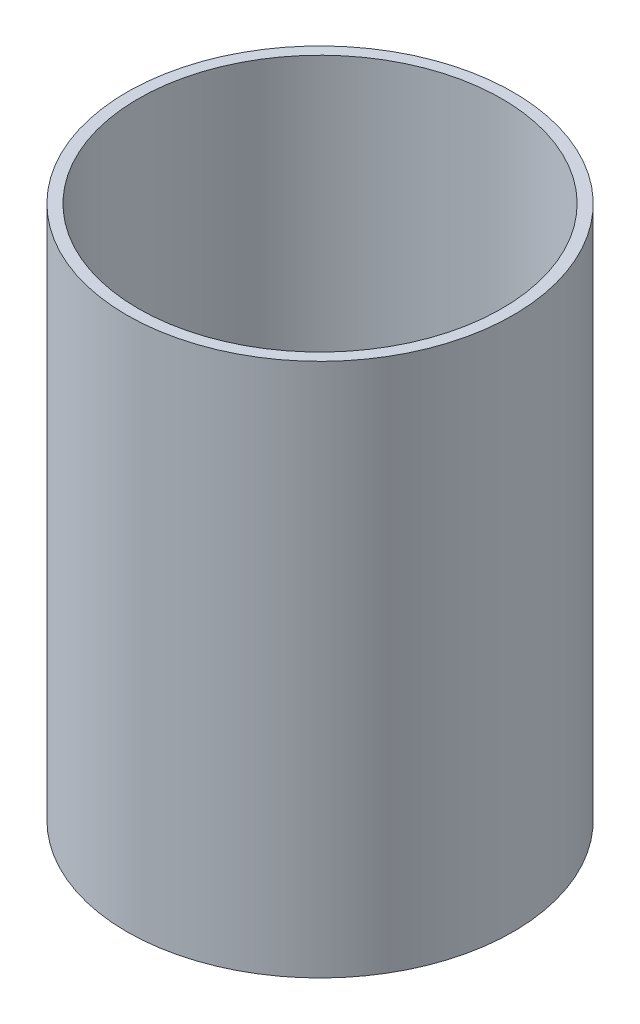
ISO-10303-21;
HEADER;
FILE_DESCRIPTION(('STEP AP214'),'2;1');
FILE_NAME('part.step','',(''),(''),'','','');
FILE_SCHEMA(('AUTOMOTIVE_DESIGN { 1 0 10303 214 1 1 1 1 }'));
ENDSEC;
DATA;
#1=APPLICATION_CONTEXT('core data for automotive mechanical design processes');
#2=APPLICATION_PROTOCOL_DEFINITION('international standard','automotive_design',2000,#1);
#3=PRODUCT_CONTEXT('',#1,'mechanical');
#4=PRODUCT('Part','Part','',(#3));
#5=PRODUCT_RELATED_PRODUCT_CATEGORY('part','',(#4));
#6=PRODUCT_DEFINITION_FORMATION('','',#4);
#7=PRODUCT_DEFINITION_CONTEXT('part definition',#1,'design');
#8=PRODUCT_DEFINITION('design','',#6,#7);
#9=PRODUCT_DEFINITION_SHAPE('','',#8);
#10=(LENGTH_UNIT() NAMED_UNIT(*) SI_UNIT(.MILLI.,.METRE.));
#11=(NAMED_UNIT(*) PLANE_ANGLE_UNIT() SI_UNIT($,.RADIAN.));
#12=(NAMED_UNIT(*) SI_UNIT($,.STERADIAN.) SOLID_ANGLE_UNIT());
#13=UNCERTAINTY_MEASURE_WITH_UNIT(LENGTH_MEASURE(1.E-05),#10,'distance_accuracy_value','');
#14=(GEOMETRIC_REPRESENTATION_CONTEXT(3) GLOBAL_UNCERTAINTY_ASSIGNED_CONTEXT((#13)) GLOBAL_UNIT_ASSIGNED_CONTEXT((#10,
#11,#12)) REPRESENTATION_CONTEXT('',''));
#15=CARTESIAN_POINT('',(0.,0.,0.));
#16=DIRECTION('',(0.,0.,1.));
#17=DIRECTION('',(1.,0.,0.));
#18=AXIS2_PLACEMENT_3D('',#15,#16,#17);
#19=CARTESIAN_POINT('',(0.,298.45,0.));
#20=DIRECTION('',(0.,1.,0.));
#21=DIRECTION('',(0.,0.,1.));
#22=AXIS2_PLACEMENT_3D('',#19,#20,#21);
#23=PLANE('',#22);
#24=CARTESIAN_POINT('',(0.,298.45,0.));
#25=DIRECTION('',(0.,1.,0.));
#26=DIRECTION('',(0.,0.,1.));
#27=AXIS2_PLACEMENT_3D('',#24,#25,#26);
#28=CIRCLE('',#27,107.95);
#29=CARTESIAN_POINT('',(0.,298.45,107.95));
#30=VERTEX_POINT('',#29);
#31=EDGE_CURVE('E10',#30,#30,#28,.T.);
#32=ORIENTED_EDGE('',*,*,#31,.T.);
#33=EDGE_LOOP('',(#32));
#34=FACE_BOUND('',#33,.T.);
#35=CARTESIAN_POINT('',(0.,298.45,0.));
#36=DIRECTION('',(0.,1.,0.));
#37=DIRECTION('',(0.,0.,1.));
#38=AXIS2_PLACEMENT_3D('',#35,#36,#37);
#39=CIRCLE('',#38,101.6);
#40=CARTESIAN_POINT('',(0.,298.45,101.6));
#41=VERTEX_POINT('',#40);
#42=EDGE_CURVE('E42',#41,#41,#39,.T.);
#43=ORIENTED_EDGE('',*,*,#42,.F.);
#44=EDGE_LOOP('',(#43));
#45=FACE_BOUND('',#44,.T.);
#46=ADVANCED_FACE('F31',(#34,#45),#23,.T.);
#47=CARTESIAN_POINT('',(0.,0.,0.));
#48=DIRECTION('',(0.,1.,0.));
#49=DIRECTION('',(0.,0.,1.));
#50=AXIS2_PLACEMENT_3D('',#47,#48,#49);
#51=PLANE('',#50);
#52=CARTESIAN_POINT('',(0.,0.,0.));
#53=DIRECTION('',(0.,1.,0.));
#54=DIRECTION('',(0.,0.,1.));
#55=AXIS2_PLACEMENT_3D('',#52,#53,#54);
#56=CIRCLE('',#55,107.95);
#57=CARTESIAN_POINT('',(0.,0.,107.95));
#58=VERTEX_POINT('',#57);
#59=EDGE_CURVE('E35',#58,#58,#56,.T.);
#60=ORIENTED_EDGE('',*,*,#59,.F.);
#61=EDGE_LOOP('',(#60));
#62=FACE_BOUND('',#61,.T.);
#63=CARTESIAN_POINT('',(0.,0.,0.));
#64=DIRECTION('',(0.,1.,0.));
#65=DIRECTION('',(0.,0.,1.));
#66=AXIS2_PLACEMENT_3D('',#63,#64,#65);
#67=CIRCLE('',#66,101.6);
#68=CARTESIAN_POINT('',(0.,0.,101.6));
#69=VERTEX_POINT('',#68);
#70=EDGE_CURVE('E44',#69,#69,#67,.T.);
#71=ORIENTED_EDGE('',*,*,#70,.T.);
#72=EDGE_LOOP('',(#71));
#73=FACE_BOUND('',#72,.T.);
#74=ADVANCED_FACE('F54',(#62,#73),#51,.F.);
#75=CARTESIAN_POINT('',(0.,298.45,0.));
#76=DIRECTION('',(0.,-1.,0.));
#77=DIRECTION('',(0.,0.,-1.));
#78=AXIS2_PLACEMENT_3D('',#75,#76,#77);
#79=CYLINDRICAL_SURFACE('',#78,107.95);
#80=ORIENTED_EDGE('',*,*,#31,.F.);
#81=EDGE_LOOP('',(#80));
#82=FACE_BOUND('',#81,.T.);
#83=ORIENTED_EDGE('',*,*,#59,.T.);
#84=EDGE_LOOP('',(#83));
#85=FACE_BOUND('',#84,.T.);
#86=ADVANCED_FACE('F33',(#82,#85),#79,.T.);
#87=CARTESIAN_POINT('',(0.,298.45,0.));
#88=DIRECTION('',(0.,-1.,0.));
#89=DIRECTION('',(0.,0.,-1.));
#90=AXIS2_PLACEMENT_3D('',#87,#88,#89);
#91=CYLINDRICAL_SURFACE('',#90,101.6);
#92=ORIENTED_EDGE('',*,*,#42,.T.);
#93=EDGE_LOOP('',(#92));
#94=FACE_BOUND('',#93,.T.);
#95=ORIENTED_EDGE('',*,*,#70,.F.);
#96=EDGE_LOOP('',(#95));
#97=FACE_BOUND('',#96,.T.);
#98=ADVANCED_FACE('F50',(#94,#97),#91,.F.);
#99=CLOSED_SHELL('',(#46,#74,#86,#98));
#100=MANIFOLD_SOLID_BREP('B2',#99);
#101=ADVANCED_BREP_SHAPE_REPRESENTATION('',(#18,#100),#14);
#102=SHAPE_DEFINITION_REPRESENTATION(#9,#101);
ENDSEC;
END-ISO-10303-21;
